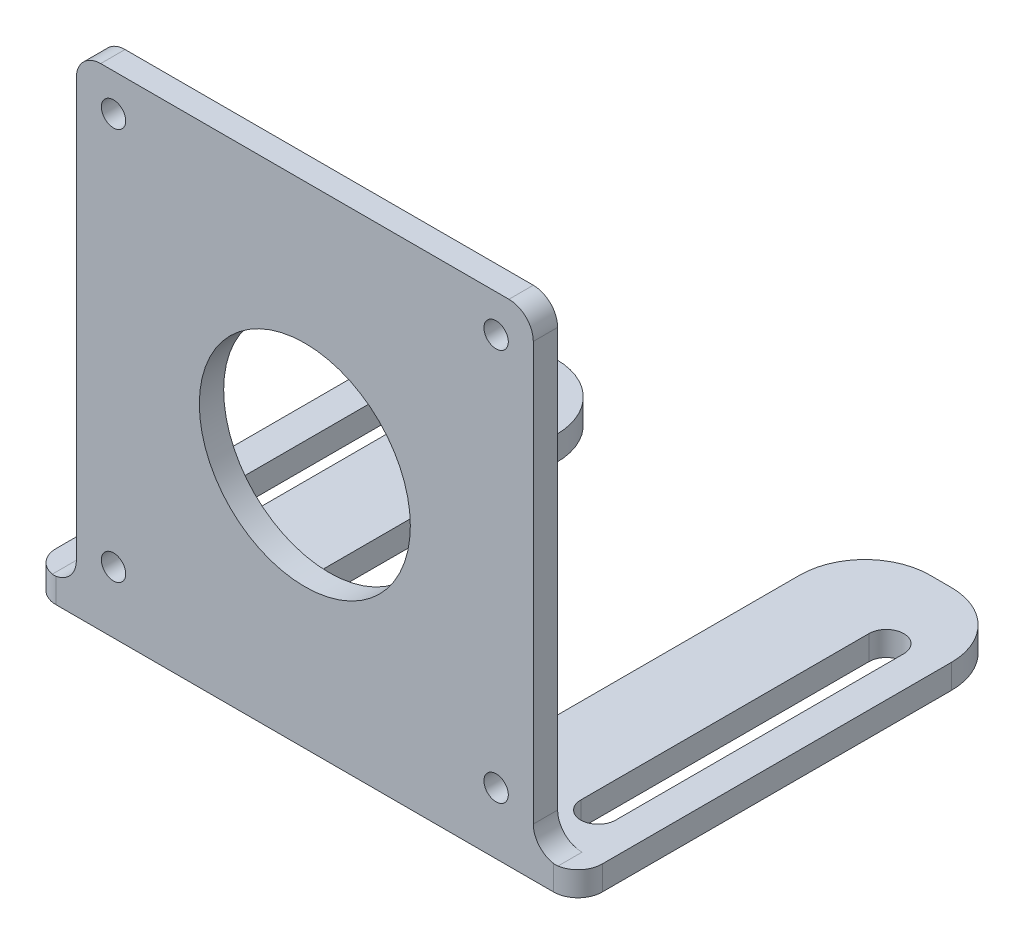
ISO-10303-21;
HEADER;
FILE_DESCRIPTION(('STEP AP214'),'2;1');
FILE_NAME('part.step','',(''),(''),'','','');
FILE_SCHEMA(('AUTOMOTIVE_DESIGN { 1 0 10303 214 1 1 1 1 }'));
ENDSEC;
DATA;
#1=APPLICATION_CONTEXT('core data for automotive mechanical design processes');
#2=APPLICATION_PROTOCOL_DEFINITION('international standard','automotive_design',2000,#1);
#3=PRODUCT_CONTEXT('',#1,'mechanical');
#4=PRODUCT('Part','Part','',(#3));
#5=PRODUCT_RELATED_PRODUCT_CATEGORY('part','',(#4));
#6=PRODUCT_DEFINITION_FORMATION('','',#4);
#7=PRODUCT_DEFINITION_CONTEXT('part definition',#1,'design');
#8=PRODUCT_DEFINITION('design','',#6,#7);
#9=PRODUCT_DEFINITION_SHAPE('','',#8);
#10=(LENGTH_UNIT() NAMED_UNIT(*) SI_UNIT(.MILLI.,.METRE.));
#11=(NAMED_UNIT(*) PLANE_ANGLE_UNIT() SI_UNIT($,.RADIAN.));
#12=(NAMED_UNIT(*) SI_UNIT($,.STERADIAN.) SOLID_ANGLE_UNIT());
#13=UNCERTAINTY_MEASURE_WITH_UNIT(LENGTH_MEASURE(1.E-05),#10,'distance_accuracy_value','');
#14=(GEOMETRIC_REPRESENTATION_CONTEXT(3) GLOBAL_UNCERTAINTY_ASSIGNED_CONTEXT((#13)) GLOBAL_UNIT_ASSIGNED_CONTEXT((#10,
#11,#12)) REPRESENTATION_CONTEXT('',''));
#15=CARTESIAN_POINT('',(0.,0.,0.));
#16=DIRECTION('',(0.,0.,1.));
#17=DIRECTION('',(1.,0.,0.));
#18=AXIS2_PLACEMENT_3D('',#15,#16,#17);
#19=CARTESIAN_POINT('',(0.,-27.25,3.));
#20=DIRECTION('',(0.,-1.,0.));
#21=DIRECTION('',(0.,0.,-1.));
#22=AXIS2_PLACEMENT_3D('',#19,#20,#21);
#23=PLANE('',#22);
#24=DIRECTION('',(0.,0.,-1.));
#25=VECTOR('',#24,1.);
#26=CARTESIAN_POINT('',(-25.5,-27.25,-5.5));
#27=LINE('',#26,#25);
#28=CARTESIAN_POINT('',(-25.5,-27.25,-5.5));
#29=VERTEX_POINT('',#28);
#30=CARTESIAN_POINT('',(-25.5,-27.25,-40.9999999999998));
#31=VERTEX_POINT('',#30);
#32=EDGE_CURVE('E262',#29,#31,#27,.T.);
#33=ORIENTED_EDGE('',*,*,#32,.F.);
#34=CARTESIAN_POINT('',(-27.65,-27.25,-5.5));
#35=DIRECTION('',(0.,1.,0.));
#36=DIRECTION('',(0.,0.,1.));
#37=AXIS2_PLACEMENT_3D('',#34,#35,#36);
#38=CIRCLE('',#37,2.15);
#39=CARTESIAN_POINT('',(-29.8,-27.25,-5.5));
#40=VERTEX_POINT('',#39);
#41=EDGE_CURVE('E267',#40,#29,#38,.T.);
#42=ORIENTED_EDGE('',*,*,#41,.F.);
#43=DIRECTION('',(0.,0.,1.));
#44=VECTOR('',#43,1.);
#45=CARTESIAN_POINT('',(-29.8,-27.25,-5.5));
#46=LINE('',#45,#44);
#47=CARTESIAN_POINT('',(-29.8,-27.25,-40.9999999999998));
#48=VERTEX_POINT('',#47);
#49=EDGE_CURVE('E271',#48,#40,#46,.T.);
#50=ORIENTED_EDGE('',*,*,#49,.F.);
#51=CARTESIAN_POINT('',(-27.65,-27.25,-40.9999999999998));
#52=DIRECTION('',(0.,1.,0.));
#53=DIRECTION('',(0.,0.,1.));
#54=AXIS2_PLACEMENT_3D('',#51,#52,#53);
#55=CIRCLE('',#54,2.15);
#56=EDGE_CURVE('E251',#31,#48,#55,.T.);
#57=ORIENTED_EDGE('',*,*,#56,.F.);
#58=EDGE_LOOP('',(#33,#42,#50,#57));
#59=FACE_BOUND('',#58,.T.);
#60=DIRECTION('',(0.,0.,-1.));
#61=VECTOR('',#60,1.);
#62=CARTESIAN_POINT('',(29.8,-27.25,-5.49999999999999));
#63=LINE('',#62,#61);
#64=CARTESIAN_POINT('',(29.8,-27.25,-5.49999999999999));
#65=VERTEX_POINT('',#64);
#66=CARTESIAN_POINT('',(29.8,-27.25,-40.9999999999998));
#67=VERTEX_POINT('',#66);
#68=EDGE_CURVE('E291',#65,#67,#63,.T.);
#69=ORIENTED_EDGE('',*,*,#68,.F.);
#70=CARTESIAN_POINT('',(27.65,-27.25,-5.49999999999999));
#71=DIRECTION('',(0.,1.,0.));
#72=DIRECTION('',(0.,0.,1.));
#73=AXIS2_PLACEMENT_3D('',#70,#71,#72);
#74=CIRCLE('',#73,2.15);
#75=CARTESIAN_POINT('',(25.5,-27.25,-5.49999999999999));
#76=VERTEX_POINT('',#75);
#77=EDGE_CURVE('E289',#76,#65,#74,.T.);
#78=ORIENTED_EDGE('',*,*,#77,.F.);
#79=DIRECTION('',(0.,0.,1.));
#80=VECTOR('',#79,1.);
#81=CARTESIAN_POINT('',(25.5,-27.25,-5.49999999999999));
#82=LINE('',#81,#80);
#83=CARTESIAN_POINT('',(25.5,-27.25,-40.9999999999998));
#84=VERTEX_POINT('',#83);
#85=EDGE_CURVE('E297',#84,#76,#82,.T.);
#86=ORIENTED_EDGE('',*,*,#85,.F.);
#87=CARTESIAN_POINT('',(27.65,-27.25,-40.9999999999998));
#88=DIRECTION('',(0.,1.,0.));
#89=DIRECTION('',(0.,0.,1.));
#90=AXIS2_PLACEMENT_3D('',#87,#88,#89);
#91=CIRCLE('',#90,2.15);
#92=EDGE_CURVE('E294',#67,#84,#91,.T.);
#93=ORIENTED_EDGE('',*,*,#92,.F.);
#94=EDGE_LOOP('',(#69,#78,#86,#93));
#95=FACE_BOUND('',#94,.T.);
#96=CARTESIAN_POINT('',(-30.65,-27.25,0.));
#97=DIRECTION('',(0.,-1.,0.));
#98=DIRECTION('',(0.,0.,-1.));
#99=AXIS2_PLACEMENT_3D('',#96,#97,#98);
#100=CIRCLE('',#99,3.);
#101=CARTESIAN_POINT('',(-33.65,-27.25,0.));
#102=VERTEX_POINT('',#101);
#103=CARTESIAN_POINT('',(-31.15,-27.25,2.95803989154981));
#104=VERTEX_POINT('',#103);
#105=EDGE_CURVE('E638',#102,#104,#100,.F.);
#106=ORIENTED_EDGE('',*,*,#105,.T.);
#107=DIRECTION('',(0.,0.,1.));
#108=VECTOR('',#107,1.);
#109=CARTESIAN_POINT('',(-31.15,-27.25,3.));
#110=LINE('',#109,#108);
#111=CARTESIAN_POINT('',(-31.15,-27.25,0.));
#112=VERTEX_POINT('',#111);
#113=EDGE_CURVE('E390',#104,#112,#110,.F.);
#114=ORIENTED_EDGE('',*,*,#113,.T.);
#115=DIRECTION('',(1.,0.,0.));
#116=VECTOR('',#115,1.);
#117=CARTESIAN_POINT('',(0.,-27.25,0.));
#118=LINE('',#117,#116);
#119=CARTESIAN_POINT('',(31.15,-27.25,0.));
#120=VERTEX_POINT('',#119);
#121=EDGE_CURVE('E340',#112,#120,#118,.T.);
#122=ORIENTED_EDGE('',*,*,#121,.T.);
#123=DIRECTION('',(0.,0.,-1.));
#124=VECTOR('',#123,1.);
#125=CARTESIAN_POINT('',(31.15,-27.25,3.));
#126=LINE('',#125,#124);
#127=CARTESIAN_POINT('',(31.15,-27.25,2.95803989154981));
#128=VERTEX_POINT('',#127);
#129=EDGE_CURVE('E388',#120,#128,#126,.F.);
#130=ORIENTED_EDGE('',*,*,#129,.T.);
#131=CARTESIAN_POINT('',(30.65,-27.25,0.));
#132=DIRECTION('',(0.,-1.,0.));
#133=DIRECTION('',(0.,0.,-1.));
#134=AXIS2_PLACEMENT_3D('',#131,#132,#133);
#135=CIRCLE('',#134,3.);
#136=CARTESIAN_POINT('',(33.65,-27.25,0.));
#137=VERTEX_POINT('',#136);
#138=EDGE_CURVE('E639',#128,#137,#135,.F.);
#139=ORIENTED_EDGE('',*,*,#138,.T.);
#140=DIRECTION('',(0.,0.,1.));
#141=VECTOR('',#140,1.);
#142=CARTESIAN_POINT('',(33.65,-27.25,-50.9999999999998));
#143=LINE('',#142,#141);
#144=CARTESIAN_POINT('',(33.65,-27.25,-42.9999999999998));
#145=VERTEX_POINT('',#144);
#146=EDGE_CURVE('E321',#145,#137,#143,.T.);
#147=ORIENTED_EDGE('',*,*,#146,.F.);
#148=CARTESIAN_POINT('',(25.65,-27.25,-42.9999999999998));
#149=DIRECTION('',(0.,-1.,0.));
#150=DIRECTION('',(0.,0.,-1.));
#151=AXIS2_PLACEMENT_3D('',#148,#149,#150);
#152=CIRCLE('',#151,8.);
#153=CARTESIAN_POINT('',(25.65,-27.25,-50.9999999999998));
#154=VERTEX_POINT('',#153);
#155=EDGE_CURVE('E620',#145,#154,#152,.F.);
#156=ORIENTED_EDGE('',*,*,#155,.T.);
#157=DIRECTION('',(-1.,0.,0.));
#158=VECTOR('',#157,1.);
#159=CARTESIAN_POINT('',(0.,-27.25,-50.9999999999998));
#160=LINE('',#159,#158);
#161=CARTESIAN_POINT('',(23.,-27.25,-50.9999999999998));
#162=VERTEX_POINT('',#161);
#163=EDGE_CURVE('E333',#154,#162,#160,.T.);
#164=ORIENTED_EDGE('',*,*,#163,.T.);
#165=CARTESIAN_POINT('',(23.,-27.25,-42.9999999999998));
#166=DIRECTION('',(0.,-1.,0.));
#167=DIRECTION('',(0.,0.,-1.));
#168=AXIS2_PLACEMENT_3D('',#165,#166,#167);
#169=CIRCLE('',#168,8.);
#170=CARTESIAN_POINT('',(15.,-27.25,-42.9999999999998));
#171=VERTEX_POINT('',#170);
#172=EDGE_CURVE('E367',#162,#171,#169,.F.);
#173=ORIENTED_EDGE('',*,*,#172,.T.);
#174=DIRECTION('',(0.,0.,-1.));
#175=VECTOR('',#174,1.);
#176=CARTESIAN_POINT('',(15.,-27.25,-54.1635284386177));
#177=LINE('',#176,#175);
#178=CARTESIAN_POINT('',(15.,-27.25,-13.));
#179=VERTEX_POINT('',#178);
#180=EDGE_CURVE('E600',#179,#171,#177,.T.);
#181=ORIENTED_EDGE('',*,*,#180,.F.);
#182=CARTESIAN_POINT('',(10.,-27.25,-13.));
#183=DIRECTION('',(0.,-1.,0.));
#184=DIRECTION('',(0.,0.,-1.));
#185=AXIS2_PLACEMENT_3D('',#182,#183,#184);
#186=CIRCLE('',#185,5.);
#187=CARTESIAN_POINT('',(10.,-27.25,-8.));
#188=VERTEX_POINT('',#187);
#189=EDGE_CURVE('E573',#179,#188,#186,.T.);
#190=ORIENTED_EDGE('',*,*,#189,.T.);
#191=DIRECTION('',(1.,0.,0.));
#192=VECTOR('',#191,1.);
#193=CARTESIAN_POINT('',(-15.,-27.25,-8.));
#194=LINE('',#193,#192);
#195=CARTESIAN_POINT('',(-10.,-27.25,-8.));
#196=VERTEX_POINT('',#195);
#197=EDGE_CURVE('E597',#196,#188,#194,.T.);
#198=ORIENTED_EDGE('',*,*,#197,.F.);
#199=CARTESIAN_POINT('',(-10.,-27.25,-13.));
#200=DIRECTION('',(0.,-1.,0.));
#201=DIRECTION('',(0.,0.,-1.));
#202=AXIS2_PLACEMENT_3D('',#199,#200,#201);
#203=CIRCLE('',#202,5.);
#204=CARTESIAN_POINT('',(-15.,-27.25,-13.));
#205=VERTEX_POINT('',#204);
#206=EDGE_CURVE('E576',#196,#205,#203,.T.);
#207=ORIENTED_EDGE('',*,*,#206,.T.);
#208=DIRECTION('',(0.,0.,1.));
#209=VECTOR('',#208,1.);
#210=CARTESIAN_POINT('',(-15.,-27.25,-54.1635284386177));
#211=LINE('',#210,#209);
#212=CARTESIAN_POINT('',(-15.,-27.25,-42.9999999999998));
#213=VERTEX_POINT('',#212);
#214=EDGE_CURVE('E596',#213,#205,#211,.T.);
#215=ORIENTED_EDGE('',*,*,#214,.F.);
#216=CARTESIAN_POINT('',(-23.,-27.25,-42.9999999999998));
#217=DIRECTION('',(0.,-1.,0.));
#218=DIRECTION('',(0.,0.,-1.));
#219=AXIS2_PLACEMENT_3D('',#216,#217,#218);
#220=CIRCLE('',#219,8.);
#221=CARTESIAN_POINT('',(-23.,-27.25,-50.9999999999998));
#222=VERTEX_POINT('',#221);
#223=EDGE_CURVE('E369',#213,#222,#220,.F.);
#224=ORIENTED_EDGE('',*,*,#223,.T.);
#225=CARTESIAN_POINT('',(-25.65,-27.25,-50.9999999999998));
#226=VERTEX_POINT('',#225);
#227=EDGE_CURVE('E332',#222,#226,#160,.T.);
#228=ORIENTED_EDGE('',*,*,#227,.T.);
#229=CARTESIAN_POINT('',(-25.65,-27.25,-42.9999999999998));
#230=DIRECTION('',(0.,-1.,0.));
#231=DIRECTION('',(0.,0.,-1.));
#232=AXIS2_PLACEMENT_3D('',#229,#230,#231);
#233=CIRCLE('',#232,8.);
#234=CARTESIAN_POINT('',(-33.65,-27.25,-42.9999999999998));
#235=VERTEX_POINT('',#234);
#236=EDGE_CURVE('E555',#226,#235,#233,.F.);
#237=ORIENTED_EDGE('',*,*,#236,.T.);
#238=DIRECTION('',(0.,0.,-1.));
#239=VECTOR('',#238,1.);
#240=CARTESIAN_POINT('',(-33.65,-27.25,-50.9999999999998));
#241=LINE('',#240,#239);
#242=EDGE_CURVE('E329',#102,#235,#241,.T.);
#243=ORIENTED_EDGE('',*,*,#242,.F.);
#244=EDGE_LOOP('',(#106,#114,#122,#130,#139,#147,#156,#164,#173,#181,#190,#198,#207,#215,#224,
#228,#237,#243));
#245=FACE_BOUND('',#244,.T.);
#246=ADVANCED_FACE('F37',(#59,#95,#245),#23,.F.);
#247=CARTESIAN_POINT('',(0.,0.,-50.9999999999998));
#248=DIRECTION('',(0.,0.,-1.));
#249=DIRECTION('',(-1.,0.,0.));
#250=AXIS2_PLACEMENT_3D('',#247,#248,#249);
#251=PLANE('',#250);
#252=ORIENTED_EDGE('',*,*,#227,.F.);
#253=DIRECTION('',(0.,1.,0.));
#254=VECTOR('',#253,1.);
#255=CARTESIAN_POINT('',(-23.,-30.25,-50.9999999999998));
#256=LINE('',#255,#254);
#257=CARTESIAN_POINT('',(-23.,-30.25,-50.9999999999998));
#258=VERTEX_POINT('',#257);
#259=EDGE_CURVE('E371',#222,#258,#256,.F.);
#260=ORIENTED_EDGE('',*,*,#259,.T.);
#261=DIRECTION('',(-1.,0.,0.));
#262=VECTOR('',#261,1.);
#263=CARTESIAN_POINT('',(0.,-30.25,-50.9999999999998));
#264=LINE('',#263,#262);
#265=CARTESIAN_POINT('',(-25.65,-30.25,-50.9999999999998));
#266=VERTEX_POINT('',#265);
#267=EDGE_CURVE('E336',#258,#266,#264,.T.);
#268=ORIENTED_EDGE('',*,*,#267,.T.);
#269=DIRECTION('',(0.,-1.,0.));
#270=VECTOR('',#269,1.);
#271=CARTESIAN_POINT('',(-25.65,0.,-50.9999999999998));
#272=LINE('',#271,#270);
#273=EDGE_CURVE('E623',#266,#226,#272,.F.);
#274=ORIENTED_EDGE('',*,*,#273,.T.);
#275=EDGE_LOOP('',(#252,#260,#268,#274));
#276=FACE_BOUND('',#275,.T.);
#277=ADVANCED_FACE('F467',(#276),#251,.T.);
#278=CARTESIAN_POINT('',(0.,0.,0.));
#279=DIRECTION('',(0.,0.,1.));
#280=DIRECTION('',(1.,0.,0.));
#281=AXIS2_PLACEMENT_3D('',#278,#279,#280);
#282=PLANE('',#281);
#283=CARTESIAN_POINT('',(23.57,-22.67,0.));
#284=DIRECTION('',(0.,0.,-1.));
#285=DIRECTION('',(-1.,0.,0.));
#286=AXIS2_PLACEMENT_3D('',#283,#284,#285);
#287=CIRCLE('',#286,1.5);
#288=CARTESIAN_POINT('',(22.07,-22.67,0.));
#289=VERTEX_POINT('',#288);
#290=EDGE_CURVE('E1034',#289,#289,#287,.T.);
#291=ORIENTED_EDGE('',*,*,#290,.F.);
#292=EDGE_LOOP('',(#291));
#293=FACE_BOUND('',#292,.T.);
#294=CARTESIAN_POINT('',(-23.57,-22.67,0.));
#295=DIRECTION('',(0.,0.,-1.));
#296=DIRECTION('',(-1.,0.,0.));
#297=AXIS2_PLACEMENT_3D('',#294,#295,#296);
#298=CIRCLE('',#297,1.5);
#299=CARTESIAN_POINT('',(-25.07,-22.67,0.));
#300=VERTEX_POINT('',#299);
#301=EDGE_CURVE('E1028',#300,#300,#298,.T.);
#302=ORIENTED_EDGE('',*,*,#301,.F.);
#303=EDGE_LOOP('',(#302));
#304=FACE_BOUND('',#303,.T.);
#305=CARTESIAN_POINT('',(-23.57,25.67,0.));
#306=DIRECTION('',(0.,0.,-1.));
#307=DIRECTION('',(-1.,0.,0.));
#308=AXIS2_PLACEMENT_3D('',#305,#306,#307);
#309=CIRCLE('',#308,1.5);
#310=CARTESIAN_POINT('',(-25.07,25.67,0.));
#311=VERTEX_POINT('',#310);
#312=EDGE_CURVE('E1020',#311,#311,#309,.T.);
#313=ORIENTED_EDGE('',*,*,#312,.F.);
#314=EDGE_LOOP('',(#313));
#315=FACE_BOUND('',#314,.T.);
#316=CARTESIAN_POINT('',(23.57,25.67,0.));
#317=DIRECTION('',(0.,0.,-1.));
#318=DIRECTION('',(-1.,0.,0.));
#319=AXIS2_PLACEMENT_3D('',#316,#317,#318);
#320=CIRCLE('',#319,1.5);
#321=CARTESIAN_POINT('',(22.07,25.67,0.));
#322=VERTEX_POINT('',#321);
#323=EDGE_CURVE('E671',#322,#322,#320,.T.);
#324=ORIENTED_EDGE('',*,*,#323,.F.);
#325=EDGE_LOOP('',(#324));
#326=FACE_BOUND('',#325,.T.);
#327=CARTESIAN_POINT('',(0.,0.,0.));
#328=DIRECTION('',(0.,0.,1.));
#329=DIRECTION('',(1.,0.,0.));
#330=AXIS2_PLACEMENT_3D('',#327,#328,#329);
#331=CIRCLE('',#330,13.);
#332=CARTESIAN_POINT('',(13.,0.,0.));
#333=VERTEX_POINT('',#332);
#334=EDGE_CURVE('E345',#333,#333,#331,.T.);
#335=ORIENTED_EDGE('',*,*,#334,.T.);
#336=EDGE_LOOP('',(#335));
#337=FACE_BOUND('',#336,.T.);
#338=DIRECTION('',(-1.,0.,0.));
#339=VECTOR('',#338,1.);
#340=CARTESIAN_POINT('',(28.15,30.25,0.));
#341=LINE('',#340,#339);
#342=CARTESIAN_POINT('',(25.15,30.25,0.));
#343=VERTEX_POINT('',#342);
#344=CARTESIAN_POINT('',(-25.15,30.25,0.));
#345=VERTEX_POINT('',#344);
#346=EDGE_CURVE('E344',#343,#345,#341,.T.);
#347=ORIENTED_EDGE('',*,*,#346,.F.);
#348=CARTESIAN_POINT('',(25.15,27.25,0.));
#349=DIRECTION('',(0.,0.,1.));
#350=DIRECTION('',(1.,0.,0.));
#351=AXIS2_PLACEMENT_3D('',#348,#349,#350);
#352=CIRCLE('',#351,3.);
#353=CARTESIAN_POINT('',(28.15,27.25,0.));
#354=VERTEX_POINT('',#353);
#355=EDGE_CURVE('E409',#343,#354,#352,.F.);
#356=ORIENTED_EDGE('',*,*,#355,.T.);
#357=DIRECTION('',(0.,1.,0.));
#358=VECTOR('',#357,1.);
#359=CARTESIAN_POINT('',(28.15,30.25,0.));
#360=LINE('',#359,#358);
#361=CARTESIAN_POINT('',(28.15,-24.25,0.));
#362=VERTEX_POINT('',#361);
#363=EDGE_CURVE('E666',#362,#354,#360,.T.);
#364=ORIENTED_EDGE('',*,*,#363,.F.);
#365=CARTESIAN_POINT('',(31.15,-24.25,0.));
#366=DIRECTION('',(0.,0.,1.));
#367=DIRECTION('',(1.,0.,0.));
#368=AXIS2_PLACEMENT_3D('',#365,#366,#367);
#369=CIRCLE('',#368,3.);
#370=EDGE_CURVE('E657',#362,#120,#369,.T.);
#371=ORIENTED_EDGE('',*,*,#370,.T.);
#372=ORIENTED_EDGE('',*,*,#121,.F.);
#373=CARTESIAN_POINT('',(-31.15,-24.25,0.));
#374=DIRECTION('',(0.,0.,1.));
#375=DIRECTION('',(1.,0.,0.));
#376=AXIS2_PLACEMENT_3D('',#373,#374,#375);
#377=CIRCLE('',#376,3.);
#378=CARTESIAN_POINT('',(-28.15,-24.25,0.));
#379=VERTEX_POINT('',#378);
#380=EDGE_CURVE('E420',#112,#379,#377,.T.);
#381=ORIENTED_EDGE('',*,*,#380,.T.);
#382=DIRECTION('',(0.,-1.,0.));
#383=VECTOR('',#382,1.);
#384=CARTESIAN_POINT('',(-28.15,30.25,0.));
#385=LINE('',#384,#383);
#386=CARTESIAN_POINT('',(-28.15,27.25,0.));
#387=VERTEX_POINT('',#386);
#388=EDGE_CURVE('E603',#387,#379,#385,.T.);
#389=ORIENTED_EDGE('',*,*,#388,.F.);
#390=CARTESIAN_POINT('',(-25.15,27.25,0.));
#391=DIRECTION('',(0.,0.,1.));
#392=DIRECTION('',(1.,0.,0.));
#393=AXIS2_PLACEMENT_3D('',#390,#391,#392);
#394=CIRCLE('',#393,3.);
#395=EDGE_CURVE('E407',#387,#345,#394,.F.);
#396=ORIENTED_EDGE('',*,*,#395,.T.);
#397=EDGE_LOOP('',(#347,#356,#364,#371,#372,#381,#389,#396));
#398=FACE_BOUND('',#397,.T.);
#399=ADVANCED_FACE('F472',(#293,#304,#315,#326,#337,#398),#282,.F.);
#400=CARTESIAN_POINT('',(0.,0.,3.));
#401=DIRECTION('',(0.,0.,1.));
#402=DIRECTION('',(1.,0.,0.));
#403=AXIS2_PLACEMENT_3D('',#400,#401,#402);
#404=PLANE('',#403);
#405=CARTESIAN_POINT('',(23.57,-22.67,3.));
#406=DIRECTION('',(0.,0.,-1.));
#407=DIRECTION('',(-1.,0.,0.));
#408=AXIS2_PLACEMENT_3D('',#405,#406,#407);
#409=CIRCLE('',#408,1.5);
#410=CARTESIAN_POINT('',(22.07,-22.67,3.));
#411=VERTEX_POINT('',#410);
#412=EDGE_CURVE('E1031',#411,#411,#409,.T.);
#413=ORIENTED_EDGE('',*,*,#412,.T.);
#414=EDGE_LOOP('',(#413));
#415=FACE_BOUND('',#414,.T.);
#416=CARTESIAN_POINT('',(-23.57,-22.67,3.));
#417=DIRECTION('',(0.,0.,-1.));
#418=DIRECTION('',(-1.,0.,0.));
#419=AXIS2_PLACEMENT_3D('',#416,#417,#418);
#420=CIRCLE('',#419,1.5);
#421=CARTESIAN_POINT('',(-25.07,-22.67,3.));
#422=VERTEX_POINT('',#421);
#423=EDGE_CURVE('E1025',#422,#422,#420,.T.);
#424=ORIENTED_EDGE('',*,*,#423,.T.);
#425=EDGE_LOOP('',(#424));
#426=FACE_BOUND('',#425,.T.);
#427=CARTESIAN_POINT('',(-23.57,25.67,3.));
#428=DIRECTION('',(0.,0.,-1.));
#429=DIRECTION('',(-1.,0.,0.));
#430=AXIS2_PLACEMENT_3D('',#427,#428,#429);
#431=CIRCLE('',#430,1.5);
#432=CARTESIAN_POINT('',(-25.07,25.67,3.));
#433=VERTEX_POINT('',#432);
#434=EDGE_CURVE('E1018',#433,#433,#431,.T.);
#435=ORIENTED_EDGE('',*,*,#434,.T.);
#436=EDGE_LOOP('',(#435));
#437=FACE_BOUND('',#436,.T.);
#438=CARTESIAN_POINT('',(23.57,25.67,3.));
#439=DIRECTION('',(0.,0.,-1.));
#440=DIRECTION('',(-1.,0.,0.));
#441=AXIS2_PLACEMENT_3D('',#438,#439,#440);
#442=CIRCLE('',#441,1.5);
#443=CARTESIAN_POINT('',(22.07,25.67,3.));
#444=VERTEX_POINT('',#443);
#445=EDGE_CURVE('E667',#444,#444,#442,.T.);
#446=ORIENTED_EDGE('',*,*,#445,.T.);
#447=EDGE_LOOP('',(#446));
#448=FACE_BOUND('',#447,.T.);
#449=DIRECTION('',(0.,-1.,0.));
#450=VECTOR('',#449,1.);
#451=CARTESIAN_POINT('',(28.15,30.25,3.));
#452=LINE('',#451,#450);
#453=CARTESIAN_POINT('',(28.15,27.25,3.));
#454=VERTEX_POINT('',#453);
#455=CARTESIAN_POINT('',(28.15,-24.25,2.99999999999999));
#456=VERTEX_POINT('',#455);
#457=EDGE_CURVE('E661',#454,#456,#452,.T.);
#458=ORIENTED_EDGE('',*,*,#457,.F.);
#459=CARTESIAN_POINT('',(25.15,27.25,3.));
#460=DIRECTION('',(0.,0.,1.));
#461=DIRECTION('',(1.,0.,0.));
#462=AXIS2_PLACEMENT_3D('',#459,#460,#461);
#463=CIRCLE('',#462,3.);
#464=CARTESIAN_POINT('',(25.15,30.25,3.));
#465=VERTEX_POINT('',#464);
#466=EDGE_CURVE('E401',#454,#465,#463,.T.);
#467=ORIENTED_EDGE('',*,*,#466,.T.);
#468=DIRECTION('',(-1.,0.,0.));
#469=VECTOR('',#468,1.);
#470=CARTESIAN_POINT('',(28.15,30.25,3.));
#471=LINE('',#470,#469);
#472=CARTESIAN_POINT('',(-25.15,30.25,3.));
#473=VERTEX_POINT('',#472);
#474=EDGE_CURVE('E350',#465,#473,#471,.T.);
#475=ORIENTED_EDGE('',*,*,#474,.T.);
#476=CARTESIAN_POINT('',(-25.15,27.25,3.));
#477=DIRECTION('',(0.,0.,1.));
#478=DIRECTION('',(1.,0.,0.));
#479=AXIS2_PLACEMENT_3D('',#476,#477,#478);
#480=CIRCLE('',#479,3.);
#481=CARTESIAN_POINT('',(-28.15,27.25,2.99999999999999));
#482=VERTEX_POINT('',#481);
#483=EDGE_CURVE('E399',#473,#482,#480,.T.);
#484=ORIENTED_EDGE('',*,*,#483,.T.);
#485=DIRECTION('',(0.,1.,0.));
#486=VECTOR('',#485,1.);
#487=CARTESIAN_POINT('',(-28.15,30.25,2.99999999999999));
#488=LINE('',#487,#486);
#489=CARTESIAN_POINT('',(-28.15,-24.25,3.));
#490=VERTEX_POINT('',#489);
#491=EDGE_CURVE('E598',#490,#482,#488,.T.);
#492=ORIENTED_EDGE('',*,*,#491,.F.);
#493=CARTESIAN_POINT('',(-31.15,-24.25,3.));
#494=DIRECTION('',(0.,0.,1.));
#495=DIRECTION('',(1.,0.,0.));
#496=AXIS2_PLACEMENT_3D('',#493,#494,#495);
#497=CIRCLE('',#496,3.);
#498=CARTESIAN_POINT('',(-30.65,-27.2080398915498,3.));
#499=VERTEX_POINT('',#498);
#500=EDGE_CURVE('E411',#490,#499,#497,.F.);
#501=ORIENTED_EDGE('',*,*,#500,.T.);
#502=DIRECTION('',(0.,1.,0.));
#503=VECTOR('',#502,1.);
#504=CARTESIAN_POINT('',(-30.65,0.,3.));
#505=LINE('',#504,#503);
#506=CARTESIAN_POINT('',(-30.65,-30.25,3.));
#507=VERTEX_POINT('',#506);
#508=EDGE_CURVE('E59',#499,#507,#505,.F.);
#509=ORIENTED_EDGE('',*,*,#508,.T.);
#510=DIRECTION('',(1.,0.,0.));
#511=VECTOR('',#510,1.);
#512=CARTESIAN_POINT('',(-28.15,-30.25,3.));
#513=LINE('',#512,#511);
#514=CARTESIAN_POINT('',(30.65,-30.25,3.));
#515=VERTEX_POINT('',#514);
#516=EDGE_CURVE('E348',#507,#515,#513,.T.);
#517=ORIENTED_EDGE('',*,*,#516,.T.);
#518=DIRECTION('',(0.,-1.,0.));
#519=VECTOR('',#518,1.);
#520=CARTESIAN_POINT('',(30.65,0.,3.));
#521=LINE('',#520,#519);
#522=CARTESIAN_POINT('',(30.65,-27.2080398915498,3.));
#523=VERTEX_POINT('',#522);
#524=EDGE_CURVE('E51',#515,#523,#521,.F.);
#525=ORIENTED_EDGE('',*,*,#524,.T.);
#526=CARTESIAN_POINT('',(31.15,-24.25,3.));
#527=DIRECTION('',(0.,0.,1.));
#528=DIRECTION('',(1.,0.,0.));
#529=AXIS2_PLACEMENT_3D('',#526,#527,#528);
#530=CIRCLE('',#529,3.);
#531=EDGE_CURVE('E11',#523,#456,#530,.F.);
#532=ORIENTED_EDGE('',*,*,#531,.T.);
#533=EDGE_LOOP('',(#458,#467,#475,#484,#492,#501,#509,#517,#525,#532));
#534=FACE_BOUND('',#533,.T.);
#535=CARTESIAN_POINT('',(0.,0.,3.));
#536=DIRECTION('',(0.,0.,1.));
#537=DIRECTION('',(1.,0.,0.));
#538=AXIS2_PLACEMENT_3D('',#535,#536,#537);
#539=CIRCLE('',#538,13.);
#540=CARTESIAN_POINT('',(13.,0.,3.));
#541=VERTEX_POINT('',#540);
#542=EDGE_CURVE('E341',#541,#541,#539,.T.);
#543=ORIENTED_EDGE('',*,*,#542,.F.);
#544=EDGE_LOOP('',(#543));
#545=FACE_BOUND('',#544,.T.);
#546=ADVANCED_FACE('F483',(#415,#426,#437,#448,#534,#545),#404,.T.);
#547=CARTESIAN_POINT('',(-28.15,-30.25,3.));
#548=DIRECTION('',(0.,1.,0.));
#549=DIRECTION('',(-1.,0.,0.));
#550=AXIS2_PLACEMENT_3D('',#547,#548,#549);
#551=PLANE('',#550);
#552=ORIENTED_EDGE('',*,*,#267,.F.);
#553=CARTESIAN_POINT('',(-23.,-30.25,-42.9999999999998));
#554=DIRECTION('',(0.,1.,0.));
#555=DIRECTION('',(-1.,0.,0.));
#556=AXIS2_PLACEMENT_3D('',#553,#554,#555);
#557=CIRCLE('',#556,8.);
#558=CARTESIAN_POINT('',(-15.,-30.25,-42.9999999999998));
#559=VERTEX_POINT('',#558);
#560=EDGE_CURVE('E375',#258,#559,#557,.F.);
#561=ORIENTED_EDGE('',*,*,#560,.T.);
#562=DIRECTION('',(0.,0.,1.));
#563=VECTOR('',#562,1.);
#564=CARTESIAN_POINT('',(-15.,-30.25,-54.1635284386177));
#565=LINE('',#564,#563);
#566=CARTESIAN_POINT('',(-15.,-30.25,-13.));
#567=VERTEX_POINT('',#566);
#568=EDGE_CURVE('E587',#559,#567,#565,.T.);
#569=ORIENTED_EDGE('',*,*,#568,.T.);
#570=CARTESIAN_POINT('',(-10.,-30.25,-13.));
#571=DIRECTION('',(0.,1.,0.));
#572=DIRECTION('',(-1.,0.,0.));
#573=AXIS2_PLACEMENT_3D('',#570,#571,#572);
#574=CIRCLE('',#573,5.);
#575=CARTESIAN_POINT('',(-10.,-30.25,-8.));
#576=VERTEX_POINT('',#575);
#577=EDGE_CURVE('E362',#567,#576,#574,.T.);
#578=ORIENTED_EDGE('',*,*,#577,.T.);
#579=DIRECTION('',(1.,0.,0.));
#580=VECTOR('',#579,1.);
#581=CARTESIAN_POINT('',(-15.,-30.25,-8.));
#582=LINE('',#581,#580);
#583=CARTESIAN_POINT('',(10.,-30.25,-8.));
#584=VERTEX_POINT('',#583);
#585=EDGE_CURVE('E584',#576,#584,#582,.T.);
#586=ORIENTED_EDGE('',*,*,#585,.T.);
#587=CARTESIAN_POINT('',(10.,-30.25,-13.));
#588=DIRECTION('',(0.,1.,0.));
#589=DIRECTION('',(-1.,0.,0.));
#590=AXIS2_PLACEMENT_3D('',#587,#588,#589);
#591=CIRCLE('',#590,5.);
#592=CARTESIAN_POINT('',(15.,-30.25,-13.));
#593=VERTEX_POINT('',#592);
#594=EDGE_CURVE('E575',#584,#593,#591,.T.);
#595=ORIENTED_EDGE('',*,*,#594,.T.);
#596=DIRECTION('',(0.,0.,-1.));
#597=VECTOR('',#596,1.);
#598=CARTESIAN_POINT('',(15.,-30.25,-54.1635284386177));
#599=LINE('',#598,#597);
#600=CARTESIAN_POINT('',(15.,-30.25,-42.9999999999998));
#601=VERTEX_POINT('',#600);
#602=EDGE_CURVE('E592',#593,#601,#599,.T.);
#603=ORIENTED_EDGE('',*,*,#602,.T.);
#604=CARTESIAN_POINT('',(23.,-30.25,-42.9999999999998));
#605=DIRECTION('',(0.,1.,0.));
#606=DIRECTION('',(-1.,0.,0.));
#607=AXIS2_PLACEMENT_3D('',#604,#605,#606);
#608=CIRCLE('',#607,8.);
#609=CARTESIAN_POINT('',(23.,-30.25,-50.9999999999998));
#610=VERTEX_POINT('',#609);
#611=EDGE_CURVE('E373',#601,#610,#608,.F.);
#612=ORIENTED_EDGE('',*,*,#611,.T.);
#613=CARTESIAN_POINT('',(25.65,-30.25,-50.9999999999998));
#614=VERTEX_POINT('',#613);
#615=EDGE_CURVE('E337',#614,#610,#264,.T.);
#616=ORIENTED_EDGE('',*,*,#615,.F.);
#617=CARTESIAN_POINT('',(25.65,-30.25,-42.9999999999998));
#618=DIRECTION('',(0.,1.,0.));
#619=DIRECTION('',(-1.,0.,0.));
#620=AXIS2_PLACEMENT_3D('',#617,#618,#619);
#621=CIRCLE('',#620,8.);
#622=CARTESIAN_POINT('',(33.65,-30.25,-42.9999999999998));
#623=VERTEX_POINT('',#622);
#624=EDGE_CURVE('E558',#614,#623,#621,.F.);
#625=ORIENTED_EDGE('',*,*,#624,.T.);
#626=DIRECTION('',(0.,0.,-1.));
#627=VECTOR('',#626,1.);
#628=CARTESIAN_POINT('',(33.65,-30.25,-50.9999999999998));
#629=LINE('',#628,#627);
#630=CARTESIAN_POINT('',(33.65,-30.25,0.));
#631=VERTEX_POINT('',#630);
#632=EDGE_CURVE('E324',#631,#623,#629,.T.);
#633=ORIENTED_EDGE('',*,*,#632,.F.);
#634=CARTESIAN_POINT('',(30.65,-30.25,0.));
#635=DIRECTION('',(0.,1.,0.));
#636=DIRECTION('',(-1.,0.,0.));
#637=AXIS2_PLACEMENT_3D('',#634,#635,#636);
#638=CIRCLE('',#637,3.);
#639=EDGE_CURVE('E637',#631,#515,#638,.F.);
#640=ORIENTED_EDGE('',*,*,#639,.T.);
#641=ORIENTED_EDGE('',*,*,#516,.F.);
#642=CARTESIAN_POINT('',(-30.65,-30.25,0.));
#643=DIRECTION('',(0.,1.,0.));
#644=DIRECTION('',(-1.,0.,0.));
#645=AXIS2_PLACEMENT_3D('',#642,#643,#644);
#646=CIRCLE('',#645,3.);
#647=CARTESIAN_POINT('',(-33.65,-30.25,0.));
#648=VERTEX_POINT('',#647);
#649=EDGE_CURVE('E636',#507,#648,#646,.F.);
#650=ORIENTED_EDGE('',*,*,#649,.T.);
#651=DIRECTION('',(0.,0.,1.));
#652=VECTOR('',#651,1.);
#653=CARTESIAN_POINT('',(-33.65,-30.25,-50.9999999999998));
#654=LINE('',#653,#652);
#655=CARTESIAN_POINT('',(-33.65,-30.25,-42.9999999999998));
#656=VERTEX_POINT('',#655);
#657=EDGE_CURVE('E327',#656,#648,#654,.T.);
#658=ORIENTED_EDGE('',*,*,#657,.F.);
#659=CARTESIAN_POINT('',(-25.65,-30.25,-42.9999999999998));
#660=DIRECTION('',(0.,1.,0.));
#661=DIRECTION('',(-1.,0.,0.));
#662=AXIS2_PLACEMENT_3D('',#659,#660,#661);
#663=CIRCLE('',#662,8.);
#664=EDGE_CURVE('E556',#656,#266,#663,.F.);
#665=ORIENTED_EDGE('',*,*,#664,.T.);
#666=EDGE_LOOP('',(#552,#561,#569,#578,#586,#595,#603,#612,#616,#625,#633,#640,#641,#650,#658,#665));
#667=FACE_BOUND('',#666,.T.);
#668=DIRECTION('',(0.,0.,1.));
#669=VECTOR('',#668,1.);
#670=CARTESIAN_POINT('',(-29.8,-30.25,3.));
#671=LINE('',#670,#669);
#672=CARTESIAN_POINT('',(-29.8,-30.25,-40.9999999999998));
#673=VERTEX_POINT('',#672);
#674=CARTESIAN_POINT('',(-29.8,-30.25,-5.5));
#675=VERTEX_POINT('',#674);
#676=EDGE_CURVE('E283',#673,#675,#671,.T.);
#677=ORIENTED_EDGE('',*,*,#676,.T.);
#678=CARTESIAN_POINT('',(-27.65,-30.25,-5.5));
#679=DIRECTION('',(0.,1.,0.));
#680=DIRECTION('',(-1.,0.,0.));
#681=AXIS2_PLACEMENT_3D('',#678,#679,#680);
#682=CIRCLE('',#681,2.15);
#683=CARTESIAN_POINT('',(-25.5,-30.25,-5.5));
#684=VERTEX_POINT('',#683);
#685=EDGE_CURVE('E286',#675,#684,#682,.T.);
#686=ORIENTED_EDGE('',*,*,#685,.T.);
#687=DIRECTION('',(0.,0.,-1.));
#688=VECTOR('',#687,1.);
#689=CARTESIAN_POINT('',(-25.5,-30.25,3.));
#690=LINE('',#689,#688);
#691=CARTESIAN_POINT('',(-25.5,-30.25,-40.9999999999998));
#692=VERTEX_POINT('',#691);
#693=EDGE_CURVE('E278',#684,#692,#690,.T.);
#694=ORIENTED_EDGE('',*,*,#693,.T.);
#695=CARTESIAN_POINT('',(-27.65,-30.25,-40.9999999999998));
#696=DIRECTION('',(0.,1.,0.));
#697=DIRECTION('',(-1.,0.,0.));
#698=AXIS2_PLACEMENT_3D('',#695,#696,#697);
#699=CIRCLE('',#698,2.15);
#700=EDGE_CURVE('E254',#692,#673,#699,.T.);
#701=ORIENTED_EDGE('',*,*,#700,.T.);
#702=EDGE_LOOP('',(#677,#686,#694,#701));
#703=FACE_BOUND('',#702,.T.);
#704=DIRECTION('',(0.,0.,1.));
#705=VECTOR('',#704,1.);
#706=CARTESIAN_POINT('',(25.5,-30.25,2.99999999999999));
#707=LINE('',#706,#705);
#708=CARTESIAN_POINT('',(25.5,-30.25,-40.9999999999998));
#709=VERTEX_POINT('',#708);
#710=CARTESIAN_POINT('',(25.5,-30.25,-5.49999999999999));
#711=VERTEX_POINT('',#710);
#712=EDGE_CURVE('E315',#709,#711,#707,.T.);
#713=ORIENTED_EDGE('',*,*,#712,.T.);
#714=CARTESIAN_POINT('',(27.65,-30.25,-5.49999999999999));
#715=DIRECTION('',(0.,1.,0.));
#716=DIRECTION('',(-1.,0.,0.));
#717=AXIS2_PLACEMENT_3D('',#714,#715,#716);
#718=CIRCLE('',#717,2.15);
#719=CARTESIAN_POINT('',(29.8,-30.25,-5.49999999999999));
#720=VERTEX_POINT('',#719);
#721=EDGE_CURVE('E318',#711,#720,#718,.T.);
#722=ORIENTED_EDGE('',*,*,#721,.T.);
#723=DIRECTION('',(0.,0.,-1.));
#724=VECTOR('',#723,1.);
#725=CARTESIAN_POINT('',(29.8,-30.25,3.));
#726=LINE('',#725,#724);
#727=CARTESIAN_POINT('',(29.8,-30.25,-40.9999999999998));
#728=VERTEX_POINT('',#727);
#729=EDGE_CURVE('E303',#720,#728,#726,.T.);
#730=ORIENTED_EDGE('',*,*,#729,.T.);
#731=CARTESIAN_POINT('',(27.65,-30.25,-40.9999999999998));
#732=DIRECTION('',(0.,1.,0.));
#733=DIRECTION('',(-1.,0.,0.));
#734=AXIS2_PLACEMENT_3D('',#731,#732,#733);
#735=CIRCLE('',#734,2.15);
#736=EDGE_CURVE('E312',#728,#709,#735,.T.);
#737=ORIENTED_EDGE('',*,*,#736,.T.);
#738=EDGE_LOOP('',(#713,#722,#730,#737));
#739=FACE_BOUND('',#738,.T.);
#740=ADVANCED_FACE('F486',(#667,#703,#739),#551,.F.);
#741=CARTESIAN_POINT('',(28.15,30.25,3.));
#742=DIRECTION('',(0.,-1.,0.));
#743=DIRECTION('',(1.,0.,0.));
#744=AXIS2_PLACEMENT_3D('',#741,#742,#743);
#745=PLANE('',#744);
#746=ORIENTED_EDGE('',*,*,#474,.F.);
#747=DIRECTION('',(0.,0.,1.));
#748=VECTOR('',#747,1.);
#749=CARTESIAN_POINT('',(25.15,30.25,0.));
#750=LINE('',#749,#748);
#751=EDGE_CURVE('E405',#465,#343,#750,.F.);
#752=ORIENTED_EDGE('',*,*,#751,.T.);
#753=ORIENTED_EDGE('',*,*,#346,.T.);
#754=DIRECTION('',(0.,0.,-1.));
#755=VECTOR('',#754,1.);
#756=CARTESIAN_POINT('',(-25.15,30.25,2.99999999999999));
#757=LINE('',#756,#755);
#758=EDGE_CURVE('E403',#345,#473,#757,.F.);
#759=ORIENTED_EDGE('',*,*,#758,.T.);
#760=EDGE_LOOP('',(#746,#752,#753,#759));
#761=FACE_BOUND('',#760,.T.);
#762=ADVANCED_FACE('F481',(#761),#745,.F.);
#763=CARTESIAN_POINT('',(0.,0.,3.));
#764=DIRECTION('',(0.,0.,-1.));
#765=DIRECTION('',(-1.,0.,0.));
#766=AXIS2_PLACEMENT_3D('',#763,#764,#765);
#767=CYLINDRICAL_SURFACE('',#766,13.);
#768=ORIENTED_EDGE('',*,*,#542,.T.);
#769=EDGE_LOOP('',(#768));
#770=FACE_BOUND('',#769,.T.);
#771=ORIENTED_EDGE('',*,*,#334,.F.);
#772=EDGE_LOOP('',(#771));
#773=FACE_BOUND('',#772,.T.);
#774=ADVANCED_FACE('F478',(#770,#773),#767,.F.);
#775=ORIENTED_EDGE('',*,*,#615,.T.);
#776=DIRECTION('',(0.,-1.,0.));
#777=VECTOR('',#776,1.);
#778=CARTESIAN_POINT('',(23.,-27.25,-50.9999999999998));
#779=LINE('',#778,#777);
#780=EDGE_CURVE('E380',#610,#162,#779,.F.);
#781=ORIENTED_EDGE('',*,*,#780,.T.);
#782=ORIENTED_EDGE('',*,*,#163,.F.);
#783=DIRECTION('',(0.,1.,0.));
#784=VECTOR('',#783,1.);
#785=CARTESIAN_POINT('',(25.65,0.,-50.9999999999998));
#786=LINE('',#785,#784);
#787=EDGE_CURVE('E626',#154,#614,#786,.F.);
#788=ORIENTED_EDGE('',*,*,#787,.T.);
#789=EDGE_LOOP('',(#775,#781,#782,#788));
#790=FACE_BOUND('',#789,.T.);
#791=ADVANCED_FACE('F475',(#790),#251,.T.);
#792=CARTESIAN_POINT('',(-33.65,0.,0.));
#793=DIRECTION('',(-1.,0.,0.));
#794=DIRECTION('',(0.,0.,1.));
#795=AXIS2_PLACEMENT_3D('',#792,#793,#794);
#796=PLANE('',#795);
#797=ORIENTED_EDGE('',*,*,#242,.T.);
#798=DIRECTION('',(0.,-1.,0.));
#799=VECTOR('',#798,1.);
#800=CARTESIAN_POINT('',(-33.65,0.,-42.9999999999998));
#801=LINE('',#800,#799);
#802=EDGE_CURVE('E548',#235,#656,#801,.T.);
#803=ORIENTED_EDGE('',*,*,#802,.T.);
#804=ORIENTED_EDGE('',*,*,#657,.T.);
#805=DIRECTION('',(0.,1.,0.));
#806=VECTOR('',#805,1.);
#807=CARTESIAN_POINT('',(-33.65,0.,0.));
#808=LINE('',#807,#806);
#809=EDGE_CURVE('E551',#648,#102,#808,.T.);
#810=ORIENTED_EDGE('',*,*,#809,.T.);
#811=EDGE_LOOP('',(#797,#803,#804,#810));
#812=FACE_BOUND('',#811,.T.);
#813=ADVANCED_FACE('F536',(#812),#796,.T.);
#814=CARTESIAN_POINT('',(33.65,0.,0.));
#815=DIRECTION('',(1.,0.,0.));
#816=DIRECTION('',(0.,0.,-1.));
#817=AXIS2_PLACEMENT_3D('',#814,#815,#816);
#818=PLANE('',#817);
#819=ORIENTED_EDGE('',*,*,#632,.T.);
#820=DIRECTION('',(0.,1.,0.));
#821=VECTOR('',#820,1.);
#822=CARTESIAN_POINT('',(33.65,0.,-42.9999999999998));
#823=LINE('',#822,#821);
#824=EDGE_CURVE('E628',#623,#145,#823,.T.);
#825=ORIENTED_EDGE('',*,*,#824,.T.);
#826=ORIENTED_EDGE('',*,*,#146,.T.);
#827=DIRECTION('',(0.,-1.,0.));
#828=VECTOR('',#827,1.);
#829=CARTESIAN_POINT('',(33.65,0.,0.));
#830=LINE('',#829,#828);
#831=EDGE_CURVE('E353',#137,#631,#830,.T.);
#832=ORIENTED_EDGE('',*,*,#831,.T.);
#833=EDGE_LOOP('',(#819,#825,#826,#832));
#834=FACE_BOUND('',#833,.T.);
#835=ADVANCED_FACE('F534',(#834),#818,.T.);
#836=CARTESIAN_POINT('',(27.65,-78.2499999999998,-5.49999999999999));
#837=DIRECTION('',(0.,1.,0.));
#838=DIRECTION('',(0.,0.,1.));
#839=AXIS2_PLACEMENT_3D('',#836,#837,#838);
#840=CYLINDRICAL_SURFACE('',#839,2.15);
#841=DIRECTION('',(0.,1.,0.));
#842=VECTOR('',#841,1.);
#843=CARTESIAN_POINT('',(25.5,-78.2499999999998,-5.49999999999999));
#844=LINE('',#843,#842);
#845=EDGE_CURVE('E301',#711,#76,#844,.T.);
#846=ORIENTED_EDGE('',*,*,#845,.T.);
#847=ORIENTED_EDGE('',*,*,#77,.T.);
#848=DIRECTION('',(0.,1.,0.));
#849=VECTOR('',#848,1.);
#850=CARTESIAN_POINT('',(29.8,-78.2499999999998,-5.49999999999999));
#851=LINE('',#850,#849);
#852=EDGE_CURVE('E300',#720,#65,#851,.T.);
#853=ORIENTED_EDGE('',*,*,#852,.F.);
#854=ORIENTED_EDGE('',*,*,#721,.F.);
#855=EDGE_LOOP('',(#846,#847,#853,#854));
#856=FACE_BOUND('',#855,.T.);
#857=ADVANCED_FACE('F516',(#856),#840,.F.);
#858=CARTESIAN_POINT('',(25.5,-78.2499999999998,-5.49999999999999));
#859=DIRECTION('',(-1.,0.,0.));
#860=DIRECTION('',(0.,0.,1.));
#861=AXIS2_PLACEMENT_3D('',#858,#859,#860);
#862=PLANE('',#861);
#863=DIRECTION('',(0.,1.,0.));
#864=VECTOR('',#863,1.);
#865=CARTESIAN_POINT('',(25.5,-78.2499999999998,-40.9999999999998));
#866=LINE('',#865,#864);
#867=EDGE_CURVE('E304',#709,#84,#866,.T.);
#868=ORIENTED_EDGE('',*,*,#867,.T.);
#869=ORIENTED_EDGE('',*,*,#85,.T.);
#870=ORIENTED_EDGE('',*,*,#845,.F.);
#871=ORIENTED_EDGE('',*,*,#712,.F.);
#872=EDGE_LOOP('',(#868,#869,#870,#871));
#873=FACE_BOUND('',#872,.T.);
#874=ADVANCED_FACE('F506',(#873),#862,.F.);
#875=CARTESIAN_POINT('',(27.65,-78.2499999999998,-40.9999999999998));
#876=DIRECTION('',(0.,1.,0.));
#877=DIRECTION('',(0.,0.,1.));
#878=AXIS2_PLACEMENT_3D('',#875,#876,#877);
#879=CYLINDRICAL_SURFACE('',#878,2.15);
#880=DIRECTION('',(0.,1.,0.));
#881=VECTOR('',#880,1.);
#882=CARTESIAN_POINT('',(29.8,-78.2499999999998,-40.9999999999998));
#883=LINE('',#882,#881);
#884=EDGE_CURVE('E306',#728,#67,#883,.T.);
#885=ORIENTED_EDGE('',*,*,#884,.T.);
#886=ORIENTED_EDGE('',*,*,#92,.T.);
#887=ORIENTED_EDGE('',*,*,#867,.F.);
#888=ORIENTED_EDGE('',*,*,#736,.F.);
#889=EDGE_LOOP('',(#885,#886,#887,#888));
#890=FACE_BOUND('',#889,.T.);
#891=ADVANCED_FACE('F508',(#890),#879,.F.);
#892=CARTESIAN_POINT('',(29.8,-78.2499999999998,-5.49999999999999));
#893=DIRECTION('',(1.,0.,0.));
#894=DIRECTION('',(0.,0.,-1.));
#895=AXIS2_PLACEMENT_3D('',#892,#893,#894);
#896=PLANE('',#895);
#897=ORIENTED_EDGE('',*,*,#852,.T.);
#898=ORIENTED_EDGE('',*,*,#68,.T.);
#899=ORIENTED_EDGE('',*,*,#884,.F.);
#900=ORIENTED_EDGE('',*,*,#729,.F.);
#901=EDGE_LOOP('',(#897,#898,#899,#900));
#902=FACE_BOUND('',#901,.T.);
#903=ADVANCED_FACE('F518',(#902),#896,.F.);
#904=CARTESIAN_POINT('',(-27.65,-78.2499999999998,-5.5));
#905=DIRECTION('',(0.,1.,0.));
#906=DIRECTION('',(0.,0.,1.));
#907=AXIS2_PLACEMENT_3D('',#904,#905,#906);
#908=CYLINDRICAL_SURFACE('',#907,2.15);
#909=DIRECTION('',(0.,1.,0.));
#910=VECTOR('',#909,1.);
#911=CARTESIAN_POINT('',(-29.8,-78.2499999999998,-5.5));
#912=LINE('',#911,#910);
#913=EDGE_CURVE('E276',#675,#40,#912,.T.);
#914=ORIENTED_EDGE('',*,*,#913,.T.);
#915=ORIENTED_EDGE('',*,*,#41,.T.);
#916=DIRECTION('',(0.,1.,0.));
#917=VECTOR('',#916,1.);
#918=CARTESIAN_POINT('',(-25.5,-78.2499999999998,-5.5));
#919=LINE('',#918,#917);
#920=EDGE_CURVE('E258',#684,#29,#919,.T.);
#921=ORIENTED_EDGE('',*,*,#920,.F.);
#922=ORIENTED_EDGE('',*,*,#685,.F.);
#923=EDGE_LOOP('',(#914,#915,#921,#922));
#924=FACE_BOUND('',#923,.T.);
#925=ADVANCED_FACE('F520',(#924),#908,.F.);
#926=CARTESIAN_POINT('',(-29.8,-78.2499999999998,-5.5));
#927=DIRECTION('',(-1.,0.,0.));
#928=DIRECTION('',(0.,0.,1.));
#929=AXIS2_PLACEMENT_3D('',#926,#927,#928);
#930=PLANE('',#929);
#931=DIRECTION('',(0.,1.,0.));
#932=VECTOR('',#931,1.);
#933=CARTESIAN_POINT('',(-29.8,-78.2499999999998,-40.9999999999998));
#934=LINE('',#933,#932);
#935=EDGE_CURVE('E257',#673,#48,#934,.T.);
#936=ORIENTED_EDGE('',*,*,#935,.T.);
#937=ORIENTED_EDGE('',*,*,#49,.T.);
#938=ORIENTED_EDGE('',*,*,#913,.F.);
#939=ORIENTED_EDGE('',*,*,#676,.F.);
#940=EDGE_LOOP('',(#936,#937,#938,#939));
#941=FACE_BOUND('',#940,.T.);
#942=ADVANCED_FACE('F526',(#941),#930,.F.);
#943=CARTESIAN_POINT('',(-27.65,-78.2499999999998,-40.9999999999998));
#944=DIRECTION('',(0.,1.,0.));
#945=DIRECTION('',(0.,0.,1.));
#946=AXIS2_PLACEMENT_3D('',#943,#944,#945);
#947=CYLINDRICAL_SURFACE('',#946,2.15);
#948=DIRECTION('',(0.,1.,0.));
#949=VECTOR('',#948,1.);
#950=CARTESIAN_POINT('',(-25.5,-78.2499999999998,-40.9999999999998));
#951=LINE('',#950,#949);
#952=EDGE_CURVE('E246',#692,#31,#951,.T.);
#953=ORIENTED_EDGE('',*,*,#952,.T.);
#954=ORIENTED_EDGE('',*,*,#56,.T.);
#955=ORIENTED_EDGE('',*,*,#935,.F.);
#956=ORIENTED_EDGE('',*,*,#700,.F.);
#957=EDGE_LOOP('',(#953,#954,#955,#956));
#958=FACE_BOUND('',#957,.T.);
#959=ADVANCED_FACE('F248',(#958),#947,.F.);
#960=CARTESIAN_POINT('',(-25.5,-78.2499999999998,-5.5));
#961=DIRECTION('',(1.,0.,0.));
#962=DIRECTION('',(0.,0.,-1.));
#963=AXIS2_PLACEMENT_3D('',#960,#961,#962);
#964=PLANE('',#963);
#965=ORIENTED_EDGE('',*,*,#920,.T.);
#966=ORIENTED_EDGE('',*,*,#32,.T.);
#967=ORIENTED_EDGE('',*,*,#952,.F.);
#968=ORIENTED_EDGE('',*,*,#693,.F.);
#969=EDGE_LOOP('',(#965,#966,#967,#968));
#970=FACE_BOUND('',#969,.T.);
#971=ADVANCED_FACE('F263',(#970),#964,.F.);
#972=CARTESIAN_POINT('',(30.65,0.,0.));
#973=DIRECTION('',(0.,-1.,0.));
#974=DIRECTION('',(0.,0.,-1.));
#975=AXIS2_PLACEMENT_3D('',#972,#973,#974);
#976=CYLINDRICAL_SURFACE('',#975,3.);
#977=ORIENTED_EDGE('',*,*,#138,.F.);
#978=CARTESIAN_POINT('',(31.15,-27.25,2.95803989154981));
#979=CARTESIAN_POINT('',(31.1084594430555,-27.2500025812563,2.96506417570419));
#980=CARTESIAN_POINT('',(31.0667694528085,-27.2491371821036,2.97120835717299));
#981=CARTESIAN_POINT('',(30.9833859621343,-27.2456587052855,2.98171251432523));
#982=CARTESIAN_POINT('',(30.9416929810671,-27.2430517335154,2.98607863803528));
#983=CARTESIAN_POINT('',(30.8583070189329,-27.2360786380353,2.99305173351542));
#984=CARTESIAN_POINT('',(30.8166140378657,-27.2317125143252,2.9956587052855));
#985=CARTESIAN_POINT('',(30.7332305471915,-27.221208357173,2.99913718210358));
#986=CARTESIAN_POINT('',(30.6915405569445,-27.2150641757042,3.0000025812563));
#987=CARTESIAN_POINT('',(30.65,-27.2080398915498,3.));
#988=B_SPLINE_CURVE_WITH_KNOTS('',3,(#978,#979,#980,#981,#982,#983,#984,#985,#986,#987),
.UNSPECIFIED.,.F.,.F.,(4,2,2,2,4),(0.,0.126373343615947,0.252305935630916,0.378238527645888,
0.504611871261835),.UNSPECIFIED.);
#989=EDGE_CURVE('E45',#128,#523,#988,.T.);
#990=ORIENTED_EDGE('',*,*,#989,.T.);
#991=ORIENTED_EDGE('',*,*,#524,.F.);
#992=ORIENTED_EDGE('',*,*,#639,.F.);
#993=ORIENTED_EDGE('',*,*,#831,.F.);
#994=EDGE_LOOP('',(#977,#990,#991,#992,#993));
#995=FACE_BOUND('',#994,.T.);
#996=ADVANCED_FACE('F432',(#995),#976,.T.);
#997=CARTESIAN_POINT('',(-30.65,0.,0.));
#998=DIRECTION('',(0.,1.,0.));
#999=DIRECTION('',(0.,0.,1.));
#1000=AXIS2_PLACEMENT_3D('',#997,#998,#999);
#1001=CYLINDRICAL_SURFACE('',#1000,3.);
#1002=ORIENTED_EDGE('',*,*,#649,.F.);
#1003=ORIENTED_EDGE('',*,*,#508,.F.);
#1004=CARTESIAN_POINT('',(-30.65,-27.2080398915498,3.));
#1005=CARTESIAN_POINT('',(-30.6915405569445,-27.2150641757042,3.0000025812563));
#1006=CARTESIAN_POINT('',(-30.7332305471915,-27.221208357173,2.99913718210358));
#1007=CARTESIAN_POINT('',(-30.8166140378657,-27.2317125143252,2.9956587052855));
#1008=CARTESIAN_POINT('',(-30.8583070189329,-27.2360786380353,2.99305173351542));
#1009=CARTESIAN_POINT('',(-30.9416929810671,-27.2430517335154,2.98607863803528));
#1010=CARTESIAN_POINT('',(-30.9833859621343,-27.2456587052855,2.98171251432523));
#1011=CARTESIAN_POINT('',(-31.0667694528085,-27.2491371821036,2.97120835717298));
#1012=CARTESIAN_POINT('',(-31.1084594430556,-27.2500025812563,2.96506417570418));
#1013=CARTESIAN_POINT('',(-31.15,-27.25,2.95803989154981));
#1014=B_SPLINE_CURVE_WITH_KNOTS('',3,(#1004,#1005,#1006,#1007,#1008,#1009,#1010,#1011,#1012,
#1013),.UNSPECIFIED.,.F.,.F.,(4,2,2,2,4),(0.,0.126373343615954,0.252305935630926,
0.378238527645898,0.504611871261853),.UNSPECIFIED.);
#1015=EDGE_CURVE('E413',#499,#104,#1014,.T.);
#1016=ORIENTED_EDGE('',*,*,#1015,.T.);
#1017=ORIENTED_EDGE('',*,*,#105,.F.);
#1018=ORIENTED_EDGE('',*,*,#809,.F.);
#1019=EDGE_LOOP('',(#1002,#1003,#1016,#1017,#1018));
#1020=FACE_BOUND('',#1019,.T.);
#1021=ADVANCED_FACE('F426',(#1020),#1001,.T.);
#1022=CARTESIAN_POINT('',(25.65,0.,-42.9999999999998));
#1023=DIRECTION('',(0.,1.,0.));
#1024=DIRECTION('',(0.,0.,1.));
#1025=AXIS2_PLACEMENT_3D('',#1022,#1023,#1024);
#1026=CYLINDRICAL_SURFACE('',#1025,8.);
#1027=ORIENTED_EDGE('',*,*,#624,.F.);
#1028=ORIENTED_EDGE('',*,*,#787,.F.);
#1029=ORIENTED_EDGE('',*,*,#155,.F.);
#1030=ORIENTED_EDGE('',*,*,#824,.F.);
#1031=EDGE_LOOP('',(#1027,#1028,#1029,#1030));
#1032=FACE_BOUND('',#1031,.T.);
#1033=ADVANCED_FACE('F431',(#1032),#1026,.T.);
#1034=CARTESIAN_POINT('',(-25.65,0.,-42.9999999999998));
#1035=DIRECTION('',(0.,-1.,0.));
#1036=DIRECTION('',(0.,0.,-1.));
#1037=AXIS2_PLACEMENT_3D('',#1034,#1035,#1036);
#1038=CYLINDRICAL_SURFACE('',#1037,8.);
#1039=ORIENTED_EDGE('',*,*,#236,.F.);
#1040=ORIENTED_EDGE('',*,*,#273,.F.);
#1041=ORIENTED_EDGE('',*,*,#664,.F.);
#1042=ORIENTED_EDGE('',*,*,#802,.F.);
#1043=EDGE_LOOP('',(#1039,#1040,#1041,#1042));
#1044=FACE_BOUND('',#1043,.T.);
#1045=ADVANCED_FACE('F437',(#1044),#1038,.T.);
#1046=CARTESIAN_POINT('',(-15.,-30.25,-54.1635284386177));
#1047=DIRECTION('',(-1.,0.,0.));
#1048=DIRECTION('',(0.,0.,1.));
#1049=AXIS2_PLACEMENT_3D('',#1046,#1047,#1048);
#1050=PLANE('',#1049);
#1051=ORIENTED_EDGE('',*,*,#568,.F.);
#1052=DIRECTION('',(0.,1.,0.));
#1053=VECTOR('',#1052,1.);
#1054=CARTESIAN_POINT('',(-15.,-27.25,-42.9999999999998));
#1055=LINE('',#1054,#1053);
#1056=EDGE_CURVE('E364',#559,#213,#1055,.T.);
#1057=ORIENTED_EDGE('',*,*,#1056,.T.);
#1058=ORIENTED_EDGE('',*,*,#214,.T.);
#1059=DIRECTION('',(0.,1.,0.));
#1060=VECTOR('',#1059,1.);
#1061=CARTESIAN_POINT('',(-15.,-30.25,-13.));
#1062=LINE('',#1061,#1060);
#1063=EDGE_CURVE('E570',#205,#567,#1062,.F.);
#1064=ORIENTED_EDGE('',*,*,#1063,.T.);
#1065=EDGE_LOOP('',(#1051,#1057,#1058,#1064));
#1066=FACE_BOUND('',#1065,.T.);
#1067=ADVANCED_FACE('F441',(#1066),#1050,.F.);
#1068=CARTESIAN_POINT('',(15.,-30.25,-54.1635284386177));
#1069=DIRECTION('',(1.,0.,0.));
#1070=DIRECTION('',(0.,0.,-1.));
#1071=AXIS2_PLACEMENT_3D('',#1068,#1069,#1070);
#1072=PLANE('',#1071);
#1073=ORIENTED_EDGE('',*,*,#180,.T.);
#1074=DIRECTION('',(0.,-1.,0.));
#1075=VECTOR('',#1074,1.);
#1076=CARTESIAN_POINT('',(15.,-30.25,-42.9999999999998));
#1077=LINE('',#1076,#1075);
#1078=EDGE_CURVE('E377',#171,#601,#1077,.T.);
#1079=ORIENTED_EDGE('',*,*,#1078,.T.);
#1080=ORIENTED_EDGE('',*,*,#602,.F.);
#1081=DIRECTION('',(0.,1.,0.));
#1082=VECTOR('',#1081,1.);
#1083=CARTESIAN_POINT('',(15.,-27.25,-13.));
#1084=LINE('',#1083,#1082);
#1085=EDGE_CURVE('E557',#593,#179,#1084,.T.);
#1086=ORIENTED_EDGE('',*,*,#1085,.T.);
#1087=EDGE_LOOP('',(#1073,#1079,#1080,#1086));
#1088=FACE_BOUND('',#1087,.T.);
#1089=ADVANCED_FACE('F613',(#1088),#1072,.F.);
#1090=CARTESIAN_POINT('',(-15.,-30.25,-8.));
#1091=DIRECTION('',(0.,0.,1.));
#1092=DIRECTION('',(1.,0.,0.));
#1093=AXIS2_PLACEMENT_3D('',#1090,#1091,#1092);
#1094=PLANE('',#1093);
#1095=ORIENTED_EDGE('',*,*,#197,.T.);
#1096=DIRECTION('',(0.,1.,0.));
#1097=VECTOR('',#1096,1.);
#1098=CARTESIAN_POINT('',(10.,-30.25,-8.));
#1099=LINE('',#1098,#1097);
#1100=EDGE_CURVE('E568',#188,#584,#1099,.F.);
#1101=ORIENTED_EDGE('',*,*,#1100,.T.);
#1102=ORIENTED_EDGE('',*,*,#585,.F.);
#1103=DIRECTION('',(0.,1.,0.));
#1104=VECTOR('',#1103,1.);
#1105=CARTESIAN_POINT('',(-10.,-27.25,-8.));
#1106=LINE('',#1105,#1104);
#1107=EDGE_CURVE('E561',#576,#196,#1106,.T.);
#1108=ORIENTED_EDGE('',*,*,#1107,.T.);
#1109=EDGE_LOOP('',(#1095,#1101,#1102,#1108));
#1110=FACE_BOUND('',#1109,.T.);
#1111=ADVANCED_FACE('F447',(#1110),#1094,.F.);
#1112=CARTESIAN_POINT('',(10.,-30.25,-13.));
#1113=DIRECTION('',(0.,-1.,0.));
#1114=DIRECTION('',(0.,0.,-1.));
#1115=AXIS2_PLACEMENT_3D('',#1112,#1113,#1114);
#1116=CYLINDRICAL_SURFACE('',#1115,5.);
#1117=ORIENTED_EDGE('',*,*,#594,.F.);
#1118=ORIENTED_EDGE('',*,*,#1100,.F.);
#1119=ORIENTED_EDGE('',*,*,#189,.F.);
#1120=ORIENTED_EDGE('',*,*,#1085,.F.);
#1121=EDGE_LOOP('',(#1117,#1118,#1119,#1120));
#1122=FACE_BOUND('',#1121,.T.);
#1123=ADVANCED_FACE('F443',(#1122),#1116,.F.);
#1124=CARTESIAN_POINT('',(-10.,-30.25,-13.));
#1125=DIRECTION('',(0.,-1.,0.));
#1126=DIRECTION('',(0.,0.,-1.));
#1127=AXIS2_PLACEMENT_3D('',#1124,#1125,#1126);
#1128=CYLINDRICAL_SURFACE('',#1127,5.);
#1129=ORIENTED_EDGE('',*,*,#577,.F.);
#1130=ORIENTED_EDGE('',*,*,#1063,.F.);
#1131=ORIENTED_EDGE('',*,*,#206,.F.);
#1132=ORIENTED_EDGE('',*,*,#1107,.F.);
#1133=EDGE_LOOP('',(#1129,#1130,#1131,#1132));
#1134=FACE_BOUND('',#1133,.T.);
#1135=ADVANCED_FACE('F446',(#1134),#1128,.F.);
#1136=CARTESIAN_POINT('',(-23.,-30.25,-42.9999999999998));
#1137=DIRECTION('',(0.,-1.,0.));
#1138=DIRECTION('',(0.,0.,-1.));
#1139=AXIS2_PLACEMENT_3D('',#1136,#1137,#1138);
#1140=CYLINDRICAL_SURFACE('',#1139,8.);
#1141=ORIENTED_EDGE('',*,*,#560,.F.);
#1142=ORIENTED_EDGE('',*,*,#259,.F.);
#1143=ORIENTED_EDGE('',*,*,#223,.F.);
#1144=ORIENTED_EDGE('',*,*,#1056,.F.);
#1145=EDGE_LOOP('',(#1141,#1142,#1143,#1144));
#1146=FACE_BOUND('',#1145,.T.);
#1147=ADVANCED_FACE('F451',(#1146),#1140,.T.);
#1148=CARTESIAN_POINT('',(23.,-30.25,-42.9999999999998));
#1149=DIRECTION('',(0.,1.,0.));
#1150=DIRECTION('',(0.,0.,1.));
#1151=AXIS2_PLACEMENT_3D('',#1148,#1149,#1150);
#1152=CYLINDRICAL_SURFACE('',#1151,8.);
#1153=ORIENTED_EDGE('',*,*,#172,.F.);
#1154=ORIENTED_EDGE('',*,*,#780,.F.);
#1155=ORIENTED_EDGE('',*,*,#611,.F.);
#1156=ORIENTED_EDGE('',*,*,#1078,.F.);
#1157=EDGE_LOOP('',(#1153,#1154,#1155,#1156));
#1158=FACE_BOUND('',#1157,.T.);
#1159=ADVANCED_FACE('F454',(#1158),#1152,.T.);
#1160=CARTESIAN_POINT('',(-28.15,0.,0.));
#1161=DIRECTION('',(-1.,0.,0.));
#1162=DIRECTION('',(0.,-1.,0.));
#1163=AXIS2_PLACEMENT_3D('',#1160,#1161,#1162);
#1164=PLANE('',#1163);
#1165=ORIENTED_EDGE('',*,*,#388,.T.);
#1166=DIRECTION('',(0.,0.,1.));
#1167=VECTOR('',#1166,1.);
#1168=CARTESIAN_POINT('',(-28.15,-24.25,0.));
#1169=LINE('',#1168,#1167);
#1170=EDGE_CURVE('E385',#379,#490,#1169,.T.);
#1171=ORIENTED_EDGE('',*,*,#1170,.T.);
#1172=ORIENTED_EDGE('',*,*,#491,.T.);
#1173=DIRECTION('',(0.,0.,-1.));
#1174=VECTOR('',#1173,1.);
#1175=CARTESIAN_POINT('',(-28.15,27.25,0.));
#1176=LINE('',#1175,#1174);
#1177=EDGE_CURVE('E382',#482,#387,#1176,.T.);
#1178=ORIENTED_EDGE('',*,*,#1177,.T.);
#1179=EDGE_LOOP('',(#1165,#1171,#1172,#1178));
#1180=FACE_BOUND('',#1179,.T.);
#1181=ADVANCED_FACE('F457',(#1180),#1164,.T.);
#1182=CARTESIAN_POINT('',(28.15,0.,0.));
#1183=DIRECTION('',(1.,0.,0.));
#1184=DIRECTION('',(0.,1.,0.));
#1185=AXIS2_PLACEMENT_3D('',#1182,#1183,#1184);
#1186=PLANE('',#1185);
#1187=ORIENTED_EDGE('',*,*,#457,.T.);
#1188=DIRECTION('',(0.,0.,-1.));
#1189=VECTOR('',#1188,1.);
#1190=CARTESIAN_POINT('',(28.15,-24.25,0.));
#1191=LINE('',#1190,#1189);
#1192=EDGE_CURVE('E396',#456,#362,#1191,.T.);
#1193=ORIENTED_EDGE('',*,*,#1192,.T.);
#1194=ORIENTED_EDGE('',*,*,#363,.T.);
#1195=DIRECTION('',(0.,0.,1.));
#1196=VECTOR('',#1195,1.);
#1197=CARTESIAN_POINT('',(28.15,27.25,3.));
#1198=LINE('',#1197,#1196);
#1199=EDGE_CURVE('E393',#354,#454,#1198,.T.);
#1200=ORIENTED_EDGE('',*,*,#1199,.T.);
#1201=EDGE_LOOP('',(#1187,#1193,#1194,#1200));
#1202=FACE_BOUND('',#1201,.T.);
#1203=ADVANCED_FACE('F462',(#1202),#1186,.T.);
#1204=CARTESIAN_POINT('',(23.57,25.67,3.));
#1205=DIRECTION('',(0.,0.,-1.));
#1206=DIRECTION('',(-1.,0.,0.));
#1207=AXIS2_PLACEMENT_3D('',#1204,#1205,#1206);
#1208=CYLINDRICAL_SURFACE('',#1207,1.5);
#1209=ORIENTED_EDGE('',*,*,#445,.F.);
#1210=EDGE_LOOP('',(#1209));
#1211=FACE_BOUND('',#1210,.T.);
#1212=ORIENTED_EDGE('',*,*,#323,.T.);
#1213=EDGE_LOOP('',(#1212));
#1214=FACE_BOUND('',#1213,.T.);
#1215=ADVANCED_FACE('F737',(#1211,#1214),#1208,.F.);
#1216=CARTESIAN_POINT('',(-23.57,25.67,3.));
#1217=DIRECTION('',(0.,0.,-1.));
#1218=DIRECTION('',(-1.,0.,0.));
#1219=AXIS2_PLACEMENT_3D('',#1216,#1217,#1218);
#1220=CYLINDRICAL_SURFACE('',#1219,1.5);
#1221=ORIENTED_EDGE('',*,*,#434,.F.);
#1222=EDGE_LOOP('',(#1221));
#1223=FACE_BOUND('',#1222,.T.);
#1224=ORIENTED_EDGE('',*,*,#312,.T.);
#1225=EDGE_LOOP('',(#1224));
#1226=FACE_BOUND('',#1225,.T.);
#1227=ADVANCED_FACE('F805',(#1223,#1226),#1220,.F.);
#1228=CARTESIAN_POINT('',(-23.57,-22.67,3.));
#1229=DIRECTION('',(0.,0.,-1.));
#1230=DIRECTION('',(-1.,0.,0.));
#1231=AXIS2_PLACEMENT_3D('',#1228,#1229,#1230);
#1232=CYLINDRICAL_SURFACE('',#1231,1.5);
#1233=ORIENTED_EDGE('',*,*,#423,.F.);
#1234=EDGE_LOOP('',(#1233));
#1235=FACE_BOUND('',#1234,.T.);
#1236=ORIENTED_EDGE('',*,*,#301,.T.);
#1237=EDGE_LOOP('',(#1236));
#1238=FACE_BOUND('',#1237,.T.);
#1239=ADVANCED_FACE('F795',(#1235,#1238),#1232,.F.);
#1240=CARTESIAN_POINT('',(23.57,-22.67,3.));
#1241=DIRECTION('',(0.,0.,-1.));
#1242=DIRECTION('',(-1.,0.,0.));
#1243=AXIS2_PLACEMENT_3D('',#1240,#1241,#1242);
#1244=CYLINDRICAL_SURFACE('',#1243,1.5);
#1245=ORIENTED_EDGE('',*,*,#412,.F.);
#1246=EDGE_LOOP('',(#1245));
#1247=FACE_BOUND('',#1246,.T.);
#1248=ORIENTED_EDGE('',*,*,#290,.T.);
#1249=EDGE_LOOP('',(#1248));
#1250=FACE_BOUND('',#1249,.T.);
#1251=ADVANCED_FACE('F727',(#1247,#1250),#1244,.F.);
#1252=CARTESIAN_POINT('',(-31.15,-24.25,0.));
#1253=DIRECTION('',(0.,0.,1.));
#1254=DIRECTION('',(1.,0.,0.));
#1255=AXIS2_PLACEMENT_3D('',#1252,#1253,#1254);
#1256=CYLINDRICAL_SURFACE('',#1255,3.);
#1257=ORIENTED_EDGE('',*,*,#380,.F.);
#1258=ORIENTED_EDGE('',*,*,#113,.F.);
#1259=ORIENTED_EDGE('',*,*,#1015,.F.);
#1260=ORIENTED_EDGE('',*,*,#500,.F.);
#1261=ORIENTED_EDGE('',*,*,#1170,.F.);
#1262=EDGE_LOOP('',(#1257,#1258,#1259,#1260,#1261));
#1263=FACE_BOUND('',#1262,.T.);
#1264=ADVANCED_FACE('F422',(#1263),#1256,.F.);
#1265=CARTESIAN_POINT('',(31.15,-24.25,0.));
#1266=DIRECTION('',(0.,0.,-1.));
#1267=DIRECTION('',(-1.,0.,0.));
#1268=AXIS2_PLACEMENT_3D('',#1265,#1266,#1267);
#1269=CYLINDRICAL_SURFACE('',#1268,3.);
#1270=ORIENTED_EDGE('',*,*,#989,.F.);
#1271=ORIENTED_EDGE('',*,*,#129,.F.);
#1272=ORIENTED_EDGE('',*,*,#370,.F.);
#1273=ORIENTED_EDGE('',*,*,#1192,.F.);
#1274=ORIENTED_EDGE('',*,*,#531,.F.);
#1275=EDGE_LOOP('',(#1270,#1271,#1272,#1273,#1274));
#1276=FACE_BOUND('',#1275,.T.);
#1277=ADVANCED_FACE('F659',(#1276),#1269,.F.);
#1278=CARTESIAN_POINT('',(25.15,27.25,0.));
#1279=DIRECTION('',(0.,0.,-1.));
#1280=DIRECTION('',(-1.,0.,0.));
#1281=AXIS2_PLACEMENT_3D('',#1278,#1279,#1280);
#1282=CYLINDRICAL_SURFACE('',#1281,3.);
#1283=ORIENTED_EDGE('',*,*,#355,.F.);
#1284=ORIENTED_EDGE('',*,*,#751,.F.);
#1285=ORIENTED_EDGE('',*,*,#466,.F.);
#1286=ORIENTED_EDGE('',*,*,#1199,.F.);
#1287=EDGE_LOOP('',(#1283,#1284,#1285,#1286));
#1288=FACE_BOUND('',#1287,.T.);
#1289=ADVANCED_FACE('F694',(#1288),#1282,.T.);
#1290=CARTESIAN_POINT('',(-25.15,27.25,0.));
#1291=DIRECTION('',(0.,0.,1.));
#1292=DIRECTION('',(1.,0.,0.));
#1293=AXIS2_PLACEMENT_3D('',#1290,#1291,#1292);
#1294=CYLINDRICAL_SURFACE('',#1293,3.);
#1295=ORIENTED_EDGE('',*,*,#483,.F.);
#1296=ORIENTED_EDGE('',*,*,#758,.F.);
#1297=ORIENTED_EDGE('',*,*,#395,.F.);
#1298=ORIENTED_EDGE('',*,*,#1177,.F.);
#1299=EDGE_LOOP('',(#1295,#1296,#1297,#1298));
#1300=FACE_BOUND('',#1299,.T.);
#1301=ADVANCED_FACE('F39',(#1300),#1294,.T.);
#1302=CLOSED_SHELL('',(#246,#277,#399,#546,#740,#762,#774,#791,#813,#835,#857,#874,#891,#903,
#925,#942,#959,#971,#996,#1021,#1033,#1045,#1067,#1089,#1111,#1123,#1135,#1147,#1159,#1181,
#1203,#1215,#1227,#1239,#1251,#1264,#1277,#1289,#1301));
#1303=MANIFOLD_SOLID_BREP('B2',#1302);
#1304=ADVANCED_BREP_SHAPE_REPRESENTATION('',(#18,#1303),#14);
#1305=SHAPE_DEFINITION_REPRESENTATION(#9,#1304);
ENDSEC;
END-ISO-10303-21;
